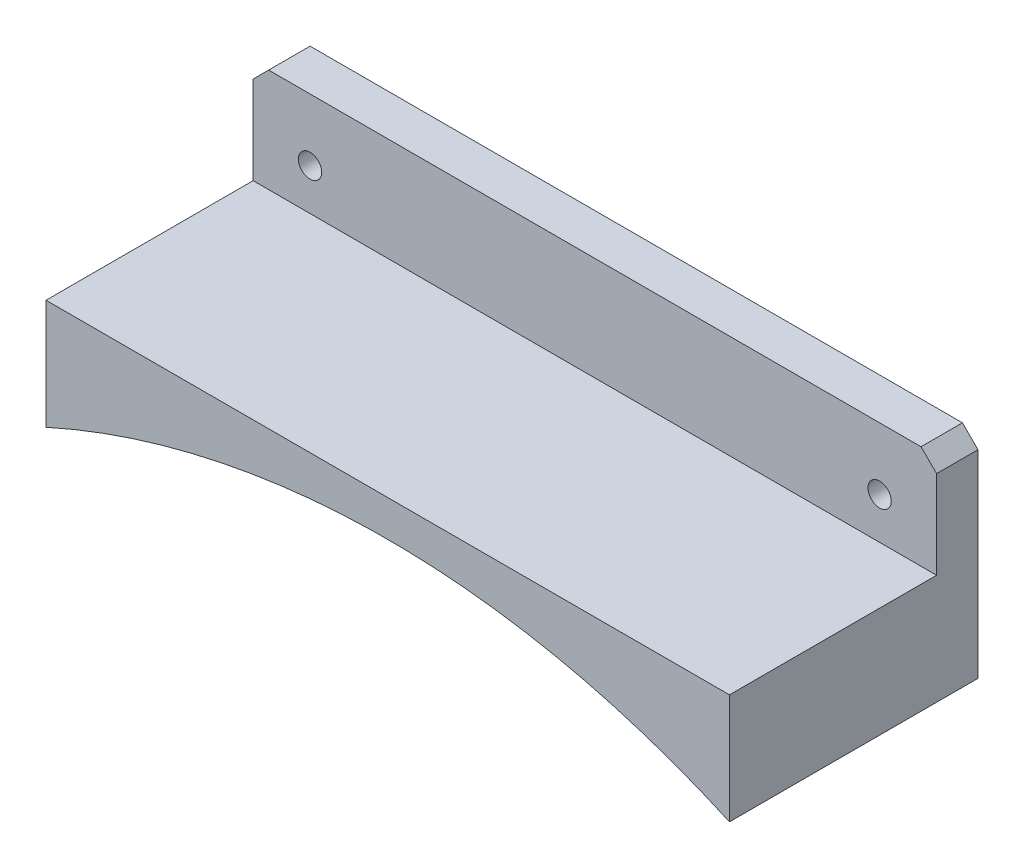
from build123d import *

# Parameters (mm, degrees)
SKETCH_1_R                    = 2.25
BACK_FLANGE_M4_PITCH110_DEPTH = 8
SADDLE_R160_DEPTH40_START     = 8
SADDLE_R160_DEPTH40_DEPTH     = 40


with BuildPart() as part:
    # Sketch 1 → Back_flange_M4_pitch110 (new body)
    with BuildSketch(Plane.XY):
        with BuildLine():
            Line((-66, 17), (-63, 20))
            Line((-63, 20), (63, 20))
            Line((63, 20), (66, 17))
            Line((66, 17), (66, -21.246783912))
            ThreePointArc((66, -21.246783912), (0, -7), (-66, -21.246783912))
            Line((-66, -21.246783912), (-66, 17))
        make_face()
        with Locations((-55, 8)):
            Circle(SKETCH_1_R, mode=Mode.SUBTRACT)
        with Locations((55, 8)):
            Circle(SKETCH_1_R, mode=Mode.SUBTRACT)
    extrude(amount=BACK_FLANGE_M4_PITCH110_DEPTH)

    # Sketch 2 → Saddle_R160_depth40 (add)
    with BuildSketch(Plane.XY.offset(SADDLE_R160_DEPTH40_START)):
        with BuildLine():
            Line((-66, 0), (66, 0))
            Line((66, 0), (66, -21.246783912))
            ThreePointArc((66, -21.246783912), (0, -7), (-66, -21.246783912))
            Line((-66, -21.246783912), (-66, 0))
        make_face()
    extrude(amount=SADDLE_R160_DEPTH40_DEPTH)


solid = part.part
